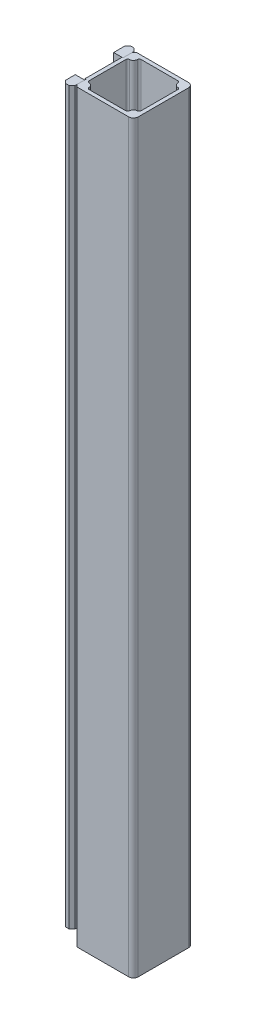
from build123d import *

# Parameters (mm, degrees)
EXTRUDE2_DEPTH                          = 1560
CUT_EXTRUDE2_DEPTH                      = 1563.501999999
EXTRUDE3_START                          = -1529.99
EXTRUDE3_DEPTH                          = 1529.99
M6X1_0_GEWINDEKERNLOCH1_D               = 6.8
M6X1_0_GEWINDEKERNLOCH1_DEPTH           = 25
M6X1_0_GEWINDEKERNLOCH1_TIP             = 1.962990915
SKIZZE6_W                               = 36
SKIZZE6_H                               = 80
AUFSATZ_LINEAR_AUSTRAGEN1_DEPTH         = 48
AUFSATZ_LINEAR_AUSTRAGEN1_2_DEPTH       = 48
SKIZZE7_R                               = 14
AUFSATZ_LINEAR_AUSTRAGEN2_DEPTH         = 114
F_5_0_5_DURCHMESSER_BOHRUNG1_AT_2_COUNT = 2
F_5_0_5_DURCHMESSER_BOHRUNG1_AT_2_PITCH = 144.616734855


with BuildPart() as part:
    # Sketch2 → Extrude2 (new body)
    with BuildSketch(Plane(origin=(0, 0, 0), x_dir=(1, 0, 0), z_dir=(0, 1, 0))):
        with BuildLine():
            Line((-62.5, -38.5), (-60.5, -38.5))
            Line((-60.5, -38.5), (-60.5, -58))
            Line((-60.5, -58), (-56, -62.5))
            Line((-56, -62.5), (52.5, -62.5))
            ThreePointArc((52.5, -62.5), (59.571067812, -59.571067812), (62.5, -52.5))
            Line((62.5, -52.5), (62.5, 52.5))
            ThreePointArc((62.5, 52.5), (59.571067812, 59.571067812), (52.5, 62.5))
            Line((52.5, 62.5), (-56, 62.5))
            Line((-56, 62.5), (-60.5, 58))
            Line((-60.5, 58), (-60.5, 38.5))
            Line((-60.5, 38.5), (-62.5, 38.5))
            Line((-62.5, 38.5), (-62.5, -38.5))
        make_face()
    extrude(amount=EXTRUDE2_DEPTH)

    # Sketch3 → Cut-Extrude2 (cut, through all)
    with BuildSketch(Plane(origin=(0, 0, 0), x_dir=(1, 0, 0), z_dir=(0, 1, 0))):
        with BuildLine():
            Line((-38.5, 54.5), (38.5, 54.5))
            ThreePointArc((38.5, 54.5), (41.328427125, 53.328427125), (42.5, 50.5))
            ThreePointArc((42.5, 50.5), (44.843145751, 44.843145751), (50.5, 42.5))
            ThreePointArc((50.5, 42.5), (53.328427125, 41.328427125), (54.5, 38.5))
            Line((54.5, 38.5), (54.5, -38.5))
            ThreePointArc((54.5, -38.5), (53.328427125, -41.328427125), (50.5, -42.5))
            ThreePointArc((50.5, -42.5), (44.843145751, -44.843145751), (42.5, -50.5))
            ThreePointArc((42.5, -50.5), (41.328427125, -53.328427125), (38.5, -54.5))
            Line((38.5, -54.5), (-38.5, -54.5))
            ThreePointArc((-38.5, -54.5), (-41.328427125, -53.328427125), (-42.5, -50.5))
            ThreePointArc((-42.5, -50.5), (-44.843145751, -44.843145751), (-50.5, -42.5))
            ThreePointArc((-50.5, -42.5), (-53.328427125, -41.328427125), (-54.5, -38.5))
            Line((-54.5, -38.5), (-54.5, 38.5))
            ThreePointArc((-54.5, 38.5), (-53.328427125, 41.328427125), (-50.5, 42.5))
            ThreePointArc((-50.5, 42.5), (-44.843145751, 44.843145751), (-42.5, 50.5))
            ThreePointArc((-42.5, 50.5), (-41.328427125, 53.328427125), (-38.5, 54.5))
        make_face()
    extrude(amount=CUT_EXTRUDE2_DEPTH, mode=Mode.SUBTRACT)

    # Sketch4 → Extrude3 (add)
    with BuildSketch(Plane(origin=(0, 1559.99, 0), x_dir=(1, 0, 0), z_dir=(0, 1, 0)).offset(EXTRUDE3_START)):
        Polygon((-60.5, -41.87), (-60.5, -62), (-66.5, -68), (-74, -68), (-80, -62), (-80, -41.87), align=None)
        Polygon((-60.5, 38.5), (-80, 38.5), (-80, 62.000000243), (-73.999999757, 68), (-66.499999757, 68), (-60.5, 61.999999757), align=None)
    extrude(amount=EXTRUDE3_DEPTH)

    # M6x1.0 Gewindekernloch1
    with Locations(Plane.XZ):
        with Locations((52.5, -52.5), (52.5, 52.5), (-52.5, 52.5), (-52.5, -52.5)):
            Hole(M6X1_0_GEWINDEKERNLOCH1_D / 2, depth=M6X1_0_GEWINDEKERNLOCH1_DEPTH)
            with Locations((0, 0, -(M6X1_0_GEWINDEKERNLOCH1_DEPTH + M6X1_0_GEWINDEKERNLOCH1_TIP / 2))):  # 120° drill point
                Cone(0, M6X1_0_GEWINDEKERNLOCH1_D / 2, M6X1_0_GEWINDEKERNLOCH1_TIP, mode=Mode.SUBTRACT)

    # Skizze8 → 5.0 _5_ Durchmesser Bohrung1 (revolve, cut)
    with BuildSketch(Plane(origin=(-42.5, 0, 58.5), x_dir=(0, 0, -1), z_dir=(1, 0, 0))):
        Polygon((0, 0), (0, 13.502151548), (2.5, 12), (2.5, 0), align=None)
    f_5_0_5_durchmesser_bohrung1 = revolve(axis=Axis((-42.5, -6.35, 58.5), (0, 1, 0)), mode=Mode.SUBTRACT)

    # 5.0 _5_ Durchmesser Bohrung1 at 2: 5.0 _5_ Durchmesser Bohrung1 ×2
    with Locations(*[Vector(0.5877604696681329, 0, -0.8090349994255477) * (i * F_5_0_5_DURCHMESSER_BOHRUNG1_AT_2_PITCH) for i in range(1, F_5_0_5_DURCHMESSER_BOHRUNG1_AT_2_COUNT)]):
        add(f_5_0_5_durchmesser_bohrung1, mode=Mode.SUBTRACT)


with BuildPart() as body_2:
    # Skizze6 → Aufsatz-Linear austragen1 (new body)
    with BuildSketch(Plane(origin=(0, 0, -62.5), x_dir=(-1, 0, 0), z_dir=(0, 0, -1))):
        with Locations((25.5, 1432.5)):
            Rectangle(SKIZZE6_W, SKIZZE6_H)
    extrude(amount=AUFSATZ_LINEAR_AUSTRAGEN1_DEPTH)


with BuildPart() as body_3:
    # Skizze6 → Aufsatz-Linear austragen1 2 (new body)
    with BuildSketch(Plane(origin=(0, 0, -62.5), x_dir=(-1, 0, 0), z_dir=(0, 0, -1))):
        with Locations((25.5, 238.5)):
            Rectangle(SKIZZE6_W, SKIZZE6_H)
    extrude(amount=AUFSATZ_LINEAR_AUSTRAGEN1_2_DEPTH)


with BuildPart() as body_4:
    # Skizze7 → Aufsatz-Linear austragen2 (new body)
    with BuildSketch(Plane.XZ.offset(-1392.5)):
        with Locations(Location((-25.5, -90.5, 0), (0, 0, 90))):
            Circle(SKIZZE7_R)
    extrude(amount=AUFSATZ_LINEAR_AUSTRAGEN2_DEPTH)


solid = Compound([part.part, body_2.part, body_3.part, body_4.part])
